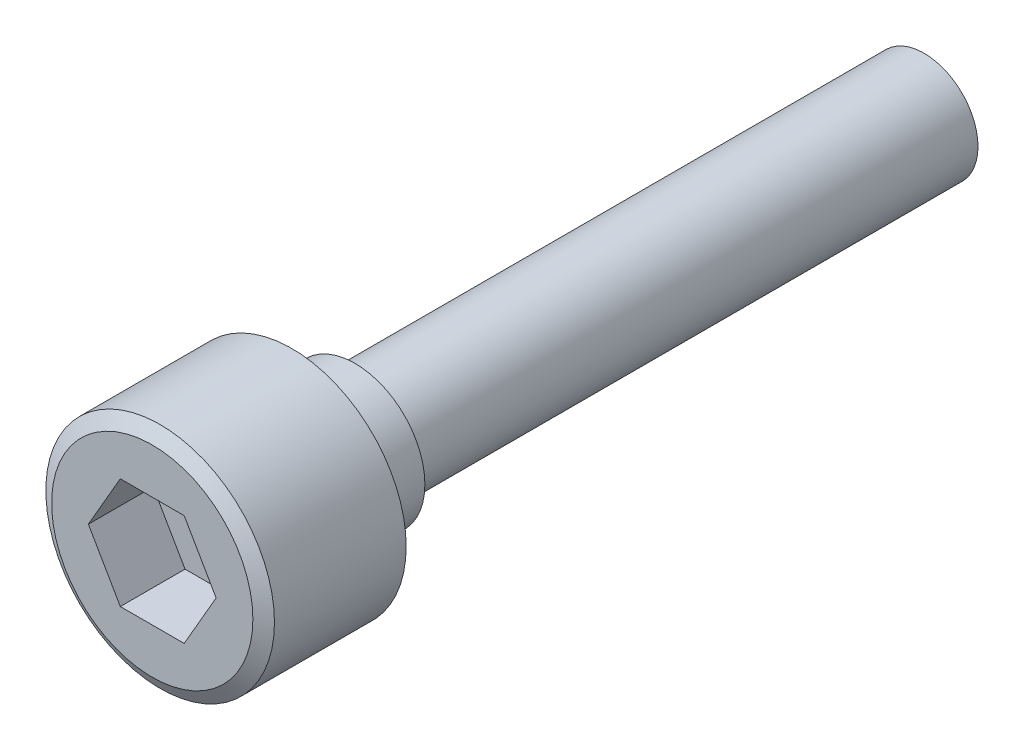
from build123d import *

# Parameters (mm, degrees)
HEX_START             = -1.625601
HEX_CUT_EXTRUDE_DEPTH = 1.625602


with BuildPart() as part:
    # SHCS Sketch → SHCS Base-Revolve (revolve)
    with BuildSketch(Plane(origin=(0, 0, 0), x_dir=(0, 0, -1), z_dir=(1, 0, 0)), mode=Mode.PRIVATE) as shcs_base_revolve_sk:
        Polygon((0, 1.3890625), (0, 2.526496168), (0.1984375, 2.8702), (3.5052, 2.8702), (3.5052, 1.7526), (5.0927, 1.7526), (5.0927, 1.35255), (19.3802, 1.35255), (19.3802, 0), (1.6256, 0), (1.6256, 1.3890625), align=None)
    revolve(shcs_base_revolve_sk.sketch.rotate(Axis((0, 0, 0), (0, 0, -1)), 90), axis=Axis((0, 0, 0), (0, 0, -1)))

    # Hex Sketch → Hex Cut-Extrude (cut)
    with BuildSketch(Plane.XY.offset(HEX_START)):
        Polygon((-0.801975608, 1.3890625), (0.801975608, 1.3890625), (1.603951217, 0), (0.801975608, -1.3890625), (-0.801975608, -1.3890625), (-1.603951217, 0), align=None)
    extrude(amount=HEX_CUT_EXTRUDE_DEPTH, mode=Mode.SUBTRACT)


solid = part.part
